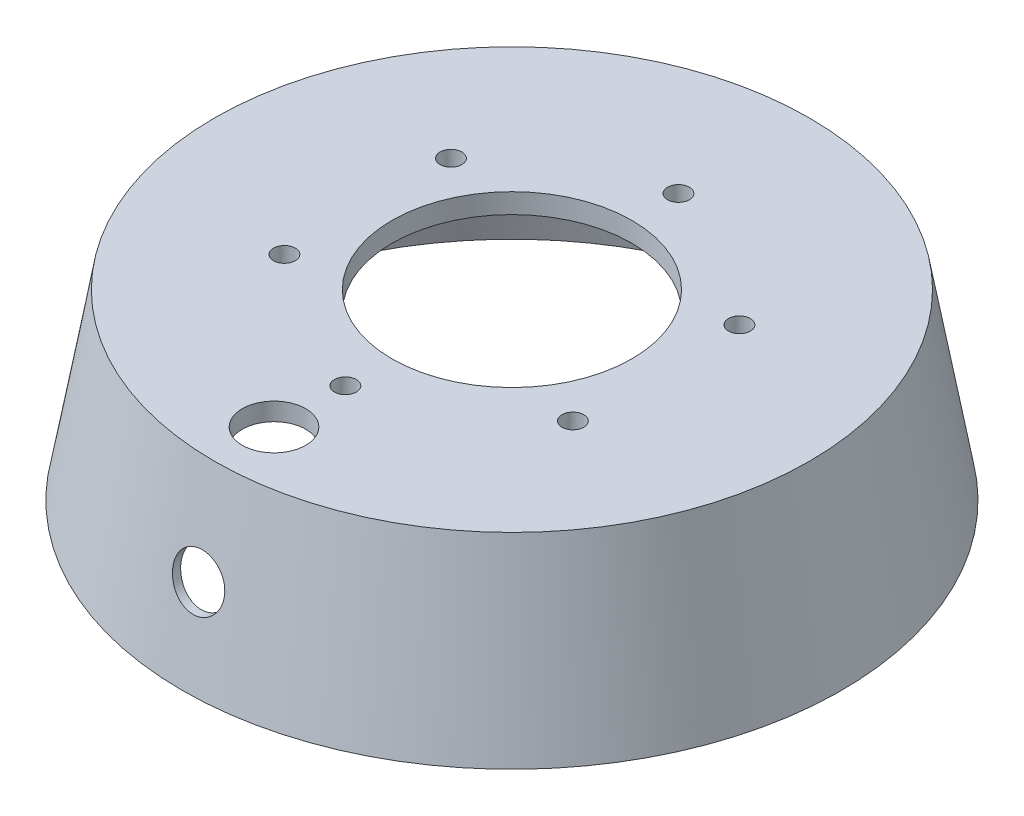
from build123d import *

# Parameters (mm, degrees)
ESQUISSE3_R                  = 30.25
ENL_V_MAT_EXTRU_1_DEPTH      = 127.343046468
ESQUISSE4_R                  = 2.75
TROU_D_BOUCHANT_DE_5_5_DEPTH = 90
R_P_TITION_CIRCULAIRE1_COUNT = 6
ESQUISSE11_R                 = 8
TROU_D_BOUCHANT_DE_16_DEPTH  = 127.343046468
ESQUISSE5_R                  = 12.5
LAMAGE_DE_1_5_DEPTH          = 1.5
ESQUISSE6_R                  = 47
ENL_V_MAT_EXTRU_4_DEPTH      = 1
ESQUISSE12_R                 = 6.5
ENL_V_MAT_EXTRU_5_DEPTH      = 91


with BuildPart() as part:
    # Esquisse1 → R_volution1 (revolve)
    with BuildSketch(Plane.XY, mode=Mode.PRIVATE) as r_volution1_sk:
        with BuildLine():
            Line((0, 56.249082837), (-75, 56.249082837))
            Line((-75, 56.249082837), (-83.11, 10.25498728))
            Line((-83.11, 10.25498728), (-81.11, 9.902333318))
            Line((-81.11, 9.902333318), (-74.432903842, 47.77002737))
            ThreePointArc((-74.432903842, 47.77002737), (-73.406843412, 49.547216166), (-71.478480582, 50.249082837))
            Line((-71.478480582, 50.249082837), (0, 50.249082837))
            Line((0, 50.249082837), (0, 56.249082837))
        make_face()
    revolve(r_volution1_sk.sketch.rotate(Axis((0, 83.073968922, 0), (0, -1, 0)), 270), axis=Axis((0, 83.073968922, 0), (0, -1, 0)))

    # Esquisse3 → Enl_v. mat.-Extru.1 (cut, through all)
    with BuildSketch(Plane(origin=(0, 56.249082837, 0), x_dir=(-1, 0, 0), z_dir=(0, 1, 0))):
        with Locations(Location((0, 0, 0), (0, 0, 90))):
            Circle(ESQUISSE3_R)
    extrude(amount=-ENL_V_MAT_EXTRU_1_DEPTH, mode=Mode.SUBTRACT)

    # Esquisse4 → Trou d_bouchant de 5_5 (cut)
    with BuildSketch(Plane(origin=(0, 56.249082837, 0), x_dir=(-1, 0, 0), z_dir=(0, 1, 0))):
        with Locations(Location((0, -42, 0), (0, 0, 90))):
            Circle(ESQUISSE4_R)
    trou_d_bouchant_de_5_5 = extrude(amount=-TROU_D_BOUCHANT_DE_5_5_DEPTH, mode=Mode.SUBTRACT)

    # R_p_tition circulaire1: Trou d_bouchant de 5_5 ×6 about axis
    r_p_tition_circulaire1_axis = Axis((0, 0, 0), (0, 1, 0))
    for i in range(1, R_P_TITION_CIRCULAIRE1_COUNT):
        add(trou_d_bouchant_de_5_5.rotate(r_p_tition_circulaire1_axis, i * 360 / R_P_TITION_CIRCULAIRE1_COUNT), mode=Mode.SUBTRACT)

    # Esquisse11 → Trou d_bouchant de 16 (cut, through all)
    with BuildSketch(Plane(origin=(0, 56.249082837, 0), x_dir=(1, 0, 0), z_dir=(0, 1, 0))):
        with Locations(Location((0, -60, 0), (0, 0, 270))):
            Circle(ESQUISSE11_R)
    extrude(amount=-TROU_D_BOUCHANT_DE_16_DEPTH, mode=Mode.SUBTRACT)

    # Esquisse5 → Lamage de 1_5 (cut)
    with BuildSketch(Plane.XZ.offset(-50.249082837)):
        with Locations(Location((0, 60, 0), (0, 0, 270))):
            Circle(ESQUISSE5_R)
    extrude(amount=-LAMAGE_DE_1_5_DEPTH, mode=Mode.SUBTRACT)

    # Esquisse6 → Enl_v. mat.-Extru.4 (cut)
    with BuildSketch(Plane.XZ.offset(-50.249082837)):
        with Locations(Location((0, 0, 0), (0, 0, 270))):
            Circle(ESQUISSE6_R)
    extrude(amount=-ENL_V_MAT_EXTRU_4_DEPTH, mode=Mode.SUBTRACT)

    # Esquisse12 → Enl_v. mat.-Extru.5 (cut)
    with BuildSketch(Plane.XY):
        with Locations(Location((0, 32.019082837, 0), (0, 0, 89.999999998))):
            Circle(ESQUISSE12_R)
    extrude(amount=ENL_V_MAT_EXTRU_5_DEPTH, mode=Mode.SUBTRACT)


solid = part.part
